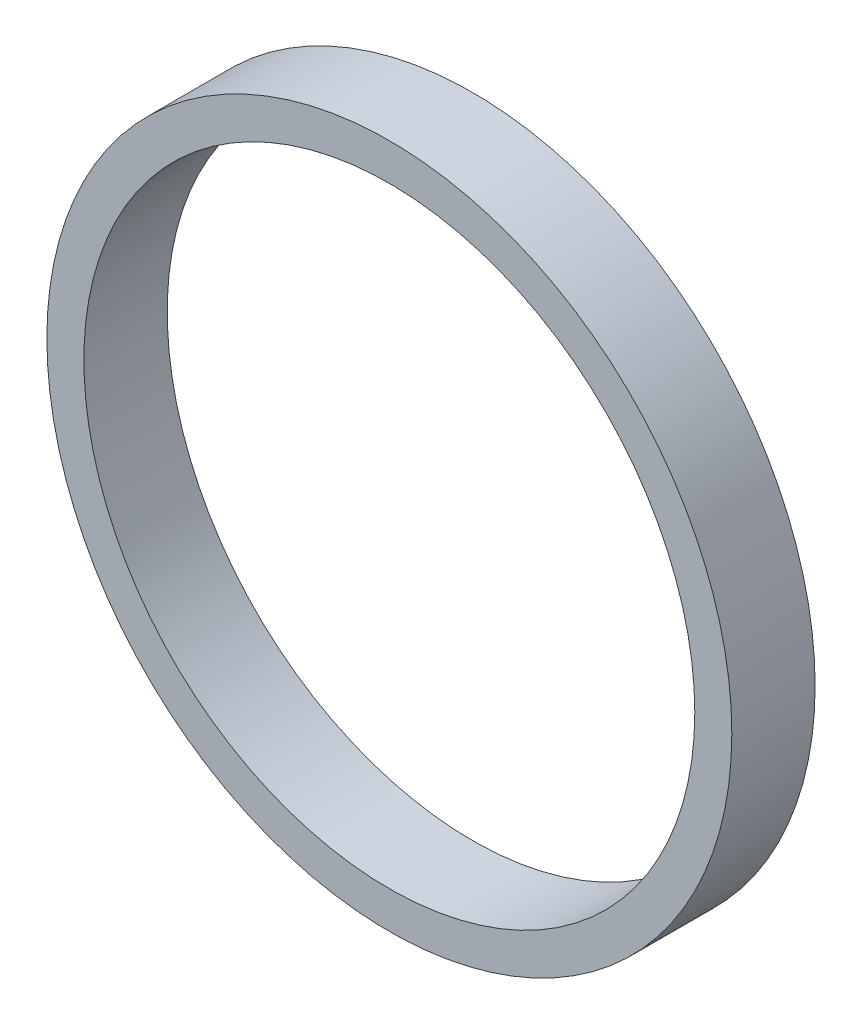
from build123d import *

# Parameters (mm, degrees)
SKETCH1_R           = 46.99
SKETCH1_R_2         = 41.91
BOSS_EXTRUDE1_DEPTH = 5.715


with BuildPart() as part:
    # Sketch1 → Boss-Extrude1 (new, symmetric)
    with BuildSketch(Plane.XY):
        Circle(SKETCH1_R)
        Circle(SKETCH1_R_2, mode=Mode.SUBTRACT)
    extrude(amount=BOSS_EXTRUDE1_DEPTH, both=True)


solid = part.part
